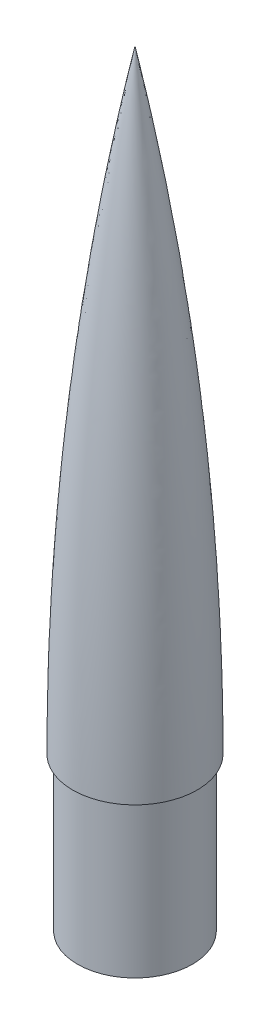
ISO-10303-21;
HEADER;
FILE_DESCRIPTION(('STEP AP214'),'2;1');
FILE_NAME('part.step','',(''),(''),'','','');
FILE_SCHEMA(('AUTOMOTIVE_DESIGN { 1 0 10303 214 1 1 1 1 }'));
ENDSEC;
DATA;
#1=APPLICATION_CONTEXT('core data for automotive mechanical design processes');
#2=APPLICATION_PROTOCOL_DEFINITION('international standard','automotive_design',2000,#1);
#3=PRODUCT_CONTEXT('',#1,'mechanical');
#4=PRODUCT('Part','Part','',(#3));
#5=PRODUCT_RELATED_PRODUCT_CATEGORY('part','',(#4));
#6=PRODUCT_DEFINITION_FORMATION('','',#4);
#7=PRODUCT_DEFINITION_CONTEXT('part definition',#1,'design');
#8=PRODUCT_DEFINITION('design','',#6,#7);
#9=PRODUCT_DEFINITION_SHAPE('','',#8);
#10=(LENGTH_UNIT() NAMED_UNIT(*) SI_UNIT(.MILLI.,.METRE.));
#11=(NAMED_UNIT(*) PLANE_ANGLE_UNIT() SI_UNIT($,.RADIAN.));
#12=(NAMED_UNIT(*) SI_UNIT($,.STERADIAN.) SOLID_ANGLE_UNIT());
#13=UNCERTAINTY_MEASURE_WITH_UNIT(LENGTH_MEASURE(1.E-05),#10,'distance_accuracy_value','');
#14=(GEOMETRIC_REPRESENTATION_CONTEXT(3) GLOBAL_UNCERTAINTY_ASSIGNED_CONTEXT((#13)) GLOBAL_UNIT_ASSIGNED_CONTEXT((#10,
#11,#12)) REPRESENTATION_CONTEXT('',''));
#15=CARTESIAN_POINT('',(0.,0.,0.));
#16=DIRECTION('',(0.,0.,1.));
#17=DIRECTION('',(1.,0.,0.));
#18=AXIS2_PLACEMENT_3D('',#15,#16,#17);
#19=CARTESIAN_POINT('',(0.,0.,0.));
#20=DIRECTION('',(0.,-1.,0.));
#21=DIRECTION('',(0.,0.,-1.));
#22=AXIS2_PLACEMENT_3D('',#19,#20,#21);
#23=PLANE('',#22);
#24=CARTESIAN_POINT('',(0.,0.,0.));
#25=DIRECTION('',(0.,1.,0.));
#26=DIRECTION('',(0.,0.,1.));
#27=AXIS2_PLACEMENT_3D('',#24,#25,#26);
#28=CIRCLE('',#27,19.05);
#29=CARTESIAN_POINT('',(0.,0.,19.05));
#30=VERTEX_POINT('',#29);
#31=EDGE_CURVE('E11',#30,#30,#28,.T.);
#32=ORIENTED_EDGE('',*,*,#31,.F.);
#33=EDGE_LOOP('',(#32));
#34=FACE_BOUND('',#33,.T.);
#35=CARTESIAN_POINT('',(0.,0.,0.));
#36=DIRECTION('',(0.,-1.,0.));
#37=DIRECTION('',(0.,0.,-1.));
#38=AXIS2_PLACEMENT_3D('',#35,#36,#37);
#39=CIRCLE('',#38,17.4625);
#40=CARTESIAN_POINT('',(0.,0.,-17.4625));
#41=VERTEX_POINT('',#40);
#42=EDGE_CURVE('E69',#41,#41,#39,.F.);
#43=ORIENTED_EDGE('',*,*,#42,.T.);
#44=EDGE_LOOP('',(#43));
#45=FACE_BOUND('',#44,.T.);
#46=ADVANCED_FACE('F31',(#34,#45),#23,.T.);
#47=CARTESIAN_POINT('',(0.,254.,0.));
#48=DIRECTION('',(0.,1.,0.));
#49=DIRECTION('',(0.,0.,1.));
#50=AXIS2_PLACEMENT_3D('',#47,#48,#49);
#51=CYLINDRICAL_SURFACE('',#50,19.05);
#52=ORIENTED_EDGE('',*,*,#31,.T.);
#53=EDGE_LOOP('',(#52));
#54=FACE_BOUND('',#53,.T.);
#55=CARTESIAN_POINT('',(0.,50.8,0.));
#56=DIRECTION('',(0.,1.,0.));
#57=DIRECTION('',(0.,0.,1.));
#58=AXIS2_PLACEMENT_3D('',#55,#56,#57);
#59=CIRCLE('',#58,19.05);
#60=CARTESIAN_POINT('',(0.,50.8,19.05));
#61=VERTEX_POINT('',#60);
#62=EDGE_CURVE('E38',#61,#61,#59,.T.);
#63=ORIENTED_EDGE('',*,*,#62,.F.);
#64=EDGE_LOOP('',(#63));
#65=FACE_BOUND('',#64,.T.);
#66=ADVANCED_FACE('F58',(#54,#65),#51,.T.);
#67=CARTESIAN_POINT('',(-19.05,50.8,0.));
#68=DIRECTION('',(0.,-1.,0.));
#69=DIRECTION('',(0.,0.,-1.));
#70=AXIS2_PLACEMENT_3D('',#67,#68,#69);
#71=PLANE('',#70);
#72=ORIENTED_EDGE('',*,*,#62,.T.);
#73=EDGE_LOOP('',(#72));
#74=FACE_BOUND('',#73,.T.);
#75=CARTESIAN_POINT('',(0.,50.8,0.));
#76=DIRECTION('',(0.,1.,0.));
#77=DIRECTION('',(0.,0.,1.));
#78=AXIS2_PLACEMENT_3D('',#75,#76,#77);
#79=CIRCLE('',#78,20.6375);
#80=CARTESIAN_POINT('',(0.,50.8,20.6375));
#81=VERTEX_POINT('',#80);
#82=EDGE_CURVE('E71',#81,#81,#79,.T.);
#83=ORIENTED_EDGE('',*,*,#82,.F.);
#84=EDGE_LOOP('',(#83));
#85=FACE_BOUND('',#84,.T.);
#86=ADVANCED_FACE('F63',(#74,#85),#71,.T.);
#87=CARTESIAN_POINT('',(0.,50.8000000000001,-990.05048076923));
#88=DIRECTION('',(-1.,0.,0.));
#89=DIRECTION('',(0.,0.,1.));
#90=AXIS2_PLACEMENT_3D('',#87,#88,#89);
#91=CIRCLE('',#90,1010.68798076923);
#92=TRIMMED_CURVE('',#91,(PARAMETER_VALUE(-0.202430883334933)),
(PARAMETER_VALUE(0.202430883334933)),.T.,.PARAMETER.);
#93=CARTESIAN_POINT('',(0.,50.8000000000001,0.));
#94=DIRECTION('',(0.,1.,0.));
#95=AXIS1_PLACEMENT('',#93,#94);
#96=SURFACE_OF_REVOLUTION('',#92,#95);
#97=ORIENTED_EDGE('',*,*,#82,.T.);
#98=EDGE_LOOP('',(#97));
#99=FACE_BOUND('',#98,.T.);
#100=CARTESIAN_POINT('',(0.,254.,0.));
#101=VERTEX_POINT('',#100);
#102=VERTEX_LOOP('',#101);
#103=FACE_BOUND('',#102,.T.);
#104=ADVANCED_FACE('F86',(#99,#103),#96,.T.);
#105=CARTESIAN_POINT('',(0.,254.,0.));
#106=DIRECTION('',(0.,1.,0.));
#107=DIRECTION('',(0.,0.,1.));
#108=AXIS2_PLACEMENT_3D('',#105,#106,#107);
#109=CYLINDRICAL_SURFACE('',#108,17.4625);
#110=ORIENTED_EDGE('',*,*,#42,.F.);
#111=EDGE_LOOP('',(#110));
#112=FACE_BOUND('',#111,.T.);
#113=CARTESIAN_POINT('',(0.,52.3875,0.));
#114=DIRECTION('',(0.,-1.,0.));
#115=DIRECTION('',(0.,0.,-1.));
#116=AXIS2_PLACEMENT_3D('',#113,#114,#115);
#117=CIRCLE('',#116,17.4625);
#118=CARTESIAN_POINT('',(0.,52.3875,-17.4625));
#119=VERTEX_POINT('',#118);
#120=EDGE_CURVE('E72',#119,#119,#117,.F.);
#121=ORIENTED_EDGE('',*,*,#120,.T.);
#122=EDGE_LOOP('',(#121));
#123=FACE_BOUND('',#122,.T.);
#124=ADVANCED_FACE('F52',(#112,#123),#109,.F.);
#125=CARTESIAN_POINT('',(-19.05,52.3875,0.));
#126=DIRECTION('',(0.,-1.,0.));
#127=DIRECTION('',(0.,0.,-1.));
#128=AXIS2_PLACEMENT_3D('',#125,#126,#127);
#129=PLANE('',#128);
#130=ORIENTED_EDGE('',*,*,#120,.F.);
#131=EDGE_LOOP('',(#130));
#132=FACE_BOUND('',#131,.T.);
#133=CARTESIAN_POINT('',(0.,52.3875,0.));
#134=DIRECTION('',(0.,-1.,0.));
#135=DIRECTION('',(0.,0.,-1.));
#136=AXIS2_PLACEMENT_3D('',#133,#134,#135);
#137=CIRCLE('',#136,19.0487512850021);
#138=CARTESIAN_POINT('',(0.,52.3875,-19.0487512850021));
#139=VERTEX_POINT('',#138);
#140=EDGE_CURVE('E77',#139,#139,#137,.F.);
#141=ORIENTED_EDGE('',*,*,#140,.T.);
#142=EDGE_LOOP('',(#141));
#143=FACE_BOUND('',#142,.T.);
#144=ADVANCED_FACE('F46',(#132,#143),#129,.F.);
#145=CARTESIAN_POINT('',(0.,50.8000000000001,-990.05048076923));
#146=DIRECTION('',(-1.,0.,0.));
#147=DIRECTION('',(0.,0.,1.));
#148=AXIS2_PLACEMENT_3D('',#145,#146,#147);
#149=CIRCLE('',#148,1009.10048076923);
#150=TRIMMED_CURVE('',#149,(PARAMETER_VALUE(-0.194617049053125)),
(PARAMETER_VALUE(0.194617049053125)),.T.,.PARAMETER.);
#151=CARTESIAN_POINT('',(0.,50.8000000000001,0.));
#152=DIRECTION('',(0.,1.,0.));
#153=AXIS1_PLACEMENT('',#151,#152);
#154=SURFACE_OF_REVOLUTION('',#150,#153);
#155=ORIENTED_EDGE('',*,*,#140,.F.);
#156=EDGE_LOOP('',(#155));
#157=FACE_BOUND('',#156,.T.);
#158=CARTESIAN_POINT('',(0.,245.95077713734,0.));
#159=VERTEX_POINT('',#158);
#160=VERTEX_LOOP('',#159);
#161=FACE_BOUND('',#160,.T.);
#162=ADVANCED_FACE('F44',(#157,#161),#154,.F.);
#163=CLOSED_SHELL('',(#46,#66,#86,#104,#124,#144,#162));
#164=MANIFOLD_SOLID_BREP('B2',#163);
#165=ADVANCED_BREP_SHAPE_REPRESENTATION('',(#18,#164),#14);
#166=SHAPE_DEFINITION_REPRESENTATION(#9,#165);
ENDSEC;
END-ISO-10303-21;
